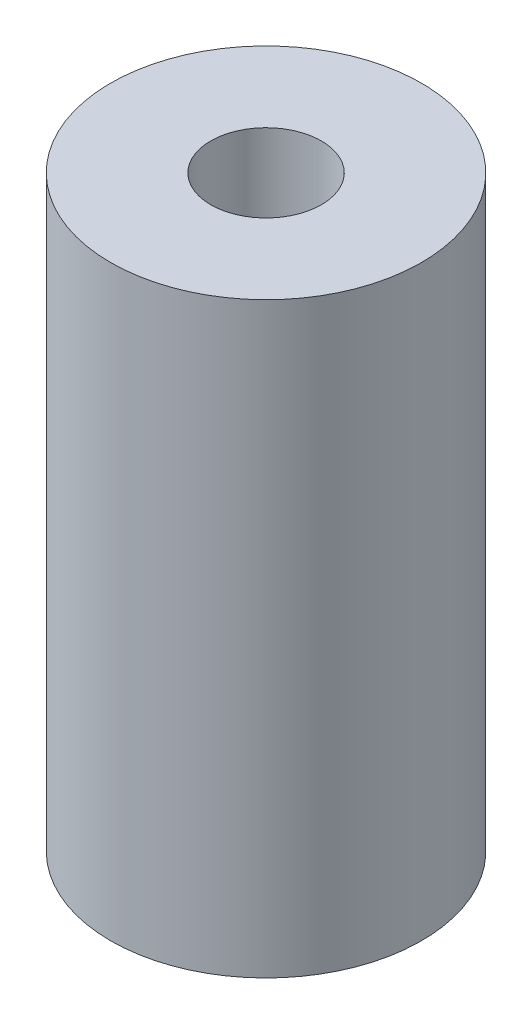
from build123d import *

# Parameters (mm, degrees)
SKETCH1_R   = 3.175
SKETCH1_R_2 = 1.1303
BODY_DEPTH  = 12


with BuildPart() as part:
    # Sketch1 → body (new body)
    with BuildSketch(Plane(origin=(0, 0, 0), x_dir=(1, 0, 0), z_dir=(0, 1, 0))):
        with Locations(Location((0, 0, 0), (0, 0, 270))):
            Circle(SKETCH1_R)
        with Locations(Location((0, 0, 0), (0, 0, 270))):
            Circle(SKETCH1_R_2, mode=Mode.SUBTRACT)
    extrude(amount=BODY_DEPTH)


solid = part.part
